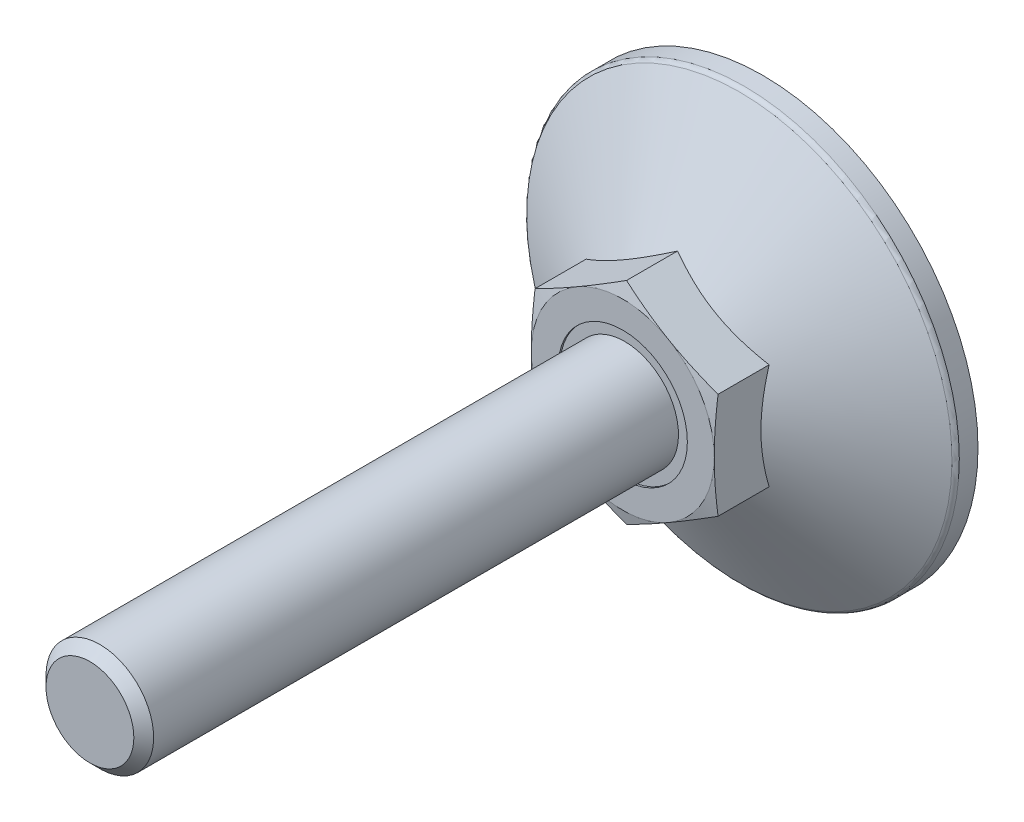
ISO-10303-21;
HEADER;
FILE_DESCRIPTION(('STEP AP214'),'2;1');
FILE_NAME('part.step','',(''),(''),'','','');
FILE_SCHEMA(('AUTOMOTIVE_DESIGN { 1 0 10303 214 1 1 1 1 }'));
ENDSEC;
DATA;
#1=APPLICATION_CONTEXT('core data for automotive mechanical design processes');
#2=APPLICATION_PROTOCOL_DEFINITION('international standard','automotive_design',2000,#1);
#3=PRODUCT_CONTEXT('',#1,'mechanical');
#4=PRODUCT('Part','Part','',(#3));
#5=PRODUCT_RELATED_PRODUCT_CATEGORY('part','',(#4));
#6=PRODUCT_DEFINITION_FORMATION('','',#4);
#7=PRODUCT_DEFINITION_CONTEXT('part definition',#1,'design');
#8=PRODUCT_DEFINITION('design','',#6,#7);
#9=PRODUCT_DEFINITION_SHAPE('','',#8);
#10=(LENGTH_UNIT() NAMED_UNIT(*) SI_UNIT(.MILLI.,.METRE.));
#11=(NAMED_UNIT(*) PLANE_ANGLE_UNIT() SI_UNIT($,.RADIAN.));
#12=(NAMED_UNIT(*) SI_UNIT($,.STERADIAN.) SOLID_ANGLE_UNIT());
#13=UNCERTAINTY_MEASURE_WITH_UNIT(LENGTH_MEASURE(1.E-05),#10,'distance_accuracy_value','');
#14=(GEOMETRIC_REPRESENTATION_CONTEXT(3) GLOBAL_UNCERTAINTY_ASSIGNED_CONTEXT((#13)) GLOBAL_UNIT_ASSIGNED_CONTEXT((#10,
#11,#12)) REPRESENTATION_CONTEXT('',''));
#15=CARTESIAN_POINT('',(0.,0.,0.));
#16=DIRECTION('',(0.,0.,1.));
#17=DIRECTION('',(1.,0.,0.));
#18=AXIS2_PLACEMENT_3D('',#15,#16,#17);
#19=CARTESIAN_POINT('',(0.,9.8149545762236,27.));
#20=DIRECTION('',(0.5,-0.86602540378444,0.));
#21=DIRECTION('',(0.86602540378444,0.5,0.));
#22=AXIS2_PLACEMENT_3D('',#19,#20,#21);
#23=PLANE('',#22);
#24=CARTESIAN_POINT('',(0.000200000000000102,9.81507004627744,12.6476280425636));
#25=CARTESIAN_POINT('',(-0.352800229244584,9.61126526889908,12.7022599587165));
#26=CARTESIAN_POINT('',(-0.706440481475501,9.40709097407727,12.7518566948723));
#27=CARTESIAN_POINT('',(-1.41496987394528,8.99802133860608,12.8389934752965));
#28=CARTESIAN_POINT('',(-1.76985946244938,8.79312573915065,12.8765286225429));
#29=CARTESIAN_POINT('',(-2.47873586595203,8.38385575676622,12.9373509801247));
#30=CARTESIAN_POINT('',(-2.83271788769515,8.17948414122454,12.9607107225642));
#31=CARTESIAN_POINT('',(-3.5411333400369,7.77048028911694,12.9920337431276));
#32=CARTESIAN_POINT('',(-3.89556667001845,7.56584811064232,13.));
#33=CARTESIAN_POINT('',(-4.60443332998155,7.15658375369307,13.));
#34=CARTESIAN_POINT('',(-4.9588666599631,6.95195157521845,12.9920337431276));
#35=CARTESIAN_POINT('',(-5.66728211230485,6.54294772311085,12.9607107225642));
#36=CARTESIAN_POINT('',(-6.02126413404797,6.33857610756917,12.9373509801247));
#37=CARTESIAN_POINT('',(-6.73014053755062,5.92930612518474,12.8765286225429));
#38=CARTESIAN_POINT('',(-7.08503012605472,5.7244105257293,12.8389934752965));
#39=CARTESIAN_POINT('',(-7.7935595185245,5.31534089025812,12.7518566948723));
#40=CARTESIAN_POINT('',(-8.14719977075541,5.11116659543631,12.7022599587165));
#41=CARTESIAN_POINT('',(-8.5002,4.90736181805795,12.6476280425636));
#42=B_SPLINE_CURVE_WITH_KNOTS('',3,(#24,#25,#26,#27,#28,#29,#30,#31,#32,#33,#34,#35,#36,#37,#38,
#39,#40,#41),.UNSPECIFIED.,.F.,.F.,(4,2,2,2,2,2,2,2,4),(0.,1.23382789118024,2.46815608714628,
3.69611406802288,4.92383440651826,6.15155474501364,7.37951272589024,8.61384092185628,
9.84766881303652),.UNSPECIFIED.);
#43=CARTESIAN_POINT('',(0.,9.8149545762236,12.6476589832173));
#44=VERTEX_POINT('',#43);
#45=CARTESIAN_POINT('',(-4.25,7.36121593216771,13.));
#46=VERTEX_POINT('',#45);
#47=EDGE_CURVE('E269',#44,#46,#42,.T.);
#48=ORIENTED_EDGE('',*,*,#47,.F.);
#49=DIRECTION('',(0.,0.,-1.));
#50=VECTOR('',#49,1.);
#51=CARTESIAN_POINT('',(0.,9.8149545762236,27.));
#52=LINE('',#51,#50);
#53=CARTESIAN_POINT('',(0.,9.8149545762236,7.90533871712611));
#54=VERTEX_POINT('',#53);
#55=EDGE_CURVE('E43',#44,#54,#52,.T.);
#56=ORIENTED_EDGE('',*,*,#55,.T.);
#57=CARTESIAN_POINT('',(-8.5002,4.90736181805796,7.90527204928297));
#58=CARTESIAN_POINT('',(-8.31336077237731,5.0152334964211,7.96754195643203));
#59=CARTESIAN_POINT('',(-8.1258249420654,5.12350735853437,8.02698579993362));
#60=CARTESIAN_POINT('',(-7.74923024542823,5.34093440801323,8.13944298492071));
#61=CARTESIAN_POINT('',(-7.56017075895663,5.45008795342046,8.19245355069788));
#62=CARTESIAN_POINT('',(-6.98996524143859,5.77929626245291,8.34079470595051));
#63=CARTESIAN_POINT('',(-6.60656835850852,6.00065055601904,8.42516916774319));
#64=CARTESIAN_POINT('',(-6.03282233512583,6.33190297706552,8.52410807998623));
#65=CARTESIAN_POINT('',(-5.8441872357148,6.44081150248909,8.55229289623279));
#66=CARTESIAN_POINT('',(-5.46606397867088,6.65912106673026,8.59955401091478));
#67=CARTESIAN_POINT('',(-5.27657589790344,6.76852206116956,8.61863111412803));
#68=CARTESIAN_POINT('',(-4.89727347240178,6.98751241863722,8.64719332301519));
#69=CARTESIAN_POINT('',(-4.70745974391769,7.0971014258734,8.65668931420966));
#70=CARTESIAN_POINT('',(-4.3276569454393,7.31638067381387,8.66588571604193));
#71=CARTESIAN_POINT('',(-4.13766788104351,7.42607091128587,8.66558642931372));
#72=CARTESIAN_POINT('',(-3.78247698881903,7.63114046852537,8.65587362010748));
#73=CARTESIAN_POINT('',(-3.61725009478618,7.7265342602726,8.64764492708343));
#74=CARTESIAN_POINT('',(-3.28718328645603,7.91709842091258,8.62393885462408));
#75=CARTESIAN_POINT('',(-3.12234339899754,8.01226877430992,8.60846098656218));
#76=CARTESIAN_POINT('',(-2.62846189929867,8.29741139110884,8.55151947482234));
#77=CARTESIAN_POINT('',(-2.30029449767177,8.48687892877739,8.49955503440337));
#78=CARTESIAN_POINT('',(-1.64047857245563,8.86782383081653,8.36964315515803));
#79=CARTESIAN_POINT('',(-1.30891425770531,9.0592525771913,8.29114502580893));
#80=CARTESIAN_POINT('',(-0.650730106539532,9.43925537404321,8.11298675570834));
#81=CARTESIAN_POINT('',(-0.324101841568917,9.62783429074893,8.01336845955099));
#82=CARTESIAN_POINT('',(0.000199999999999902,9.81507004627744,7.90527204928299));
#83=B_SPLINE_CURVE_WITH_KNOTS('',3,(#57,#58,#59,#60,#61,#62,#63,#64,#65,#66,#67,#68,#69,#70,#71,
#72,#73,#74,#75,#76,#77,#78,#79,#80,#81,#82),.UNSPECIFIED.,.F.,.F.,(4,2,2,2,2,2,2,2,2,2,2,2,4),
(0.,0.673596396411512,1.34748239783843,2.69805431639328,3.35679995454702,4.01548737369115,
4.67342558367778,5.33134346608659,5.90409556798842,6.47688628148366,7.62328361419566,
8.79510569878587,9.96462743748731),.UNSPECIFIED.);
#84=CARTESIAN_POINT('',(-8.5,4.9074772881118,7.90533871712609));
#85=VERTEX_POINT('',#84);
#86=EDGE_CURVE('E237',#85,#54,#83,.T.);
#87=ORIENTED_EDGE('',*,*,#86,.F.);
#88=DIRECTION('',(0.,0.,-1.));
#89=VECTOR('',#88,1.);
#90=CARTESIAN_POINT('',(-8.5,4.9074772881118,27.));
#91=LINE('',#90,#89);
#92=CARTESIAN_POINT('',(-8.5,4.9074772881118,12.6476589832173));
#93=VERTEX_POINT('',#92);
#94=EDGE_CURVE('E282',#93,#85,#91,.T.);
#95=ORIENTED_EDGE('',*,*,#94,.F.);
#96=EDGE_CURVE('E169',#46,#93,#42,.T.);
#97=ORIENTED_EDGE('',*,*,#96,.F.);
#98=EDGE_LOOP('',(#48,#56,#87,#95,#97));
#99=FACE_BOUND('',#98,.T.);
#100=ADVANCED_FACE('F14',(#99),#23,.F.);
#101=CARTESIAN_POINT('',(8.5,4.9074772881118,27.));
#102=DIRECTION('',(-0.5,-0.86602540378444,0.));
#103=DIRECTION('',(0.86602540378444,-0.5,0.));
#104=AXIS2_PLACEMENT_3D('',#101,#102,#103);
#105=PLANE('',#104);
#106=CARTESIAN_POINT('',(8.5002,4.90736181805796,12.6476280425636));
#107=CARTESIAN_POINT('',(8.14719977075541,5.11116659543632,12.7022599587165));
#108=CARTESIAN_POINT('',(7.7935595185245,5.31534089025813,12.7518566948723));
#109=CARTESIAN_POINT('',(7.08503012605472,5.72441052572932,12.8389934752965));
#110=CARTESIAN_POINT('',(6.73014053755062,5.92930612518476,12.8765286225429));
#111=CARTESIAN_POINT('',(6.02126413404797,6.33857610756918,12.9373509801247));
#112=CARTESIAN_POINT('',(5.66728211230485,6.54294772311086,12.9607107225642));
#113=CARTESIAN_POINT('',(4.9588666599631,6.95195157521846,12.9920337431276));
#114=CARTESIAN_POINT('',(4.60443332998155,7.15658375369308,13.));
#115=CARTESIAN_POINT('',(3.89556667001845,7.56584811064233,13.));
#116=CARTESIAN_POINT('',(3.5411333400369,7.77048028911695,12.9920337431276));
#117=CARTESIAN_POINT('',(2.83271788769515,8.17948414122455,12.9607107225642));
#118=CARTESIAN_POINT('',(2.47873586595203,8.38385575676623,12.9373509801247));
#119=CARTESIAN_POINT('',(1.76985946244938,8.79312573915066,12.8765286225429));
#120=CARTESIAN_POINT('',(1.41496987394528,8.9980213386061,12.8389934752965));
#121=CARTESIAN_POINT('',(0.706440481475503,9.40709097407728,12.7518566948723));
#122=CARTESIAN_POINT('',(0.352800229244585,9.61126526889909,12.7022599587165));
#123=CARTESIAN_POINT('',(-0.000200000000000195,9.81507004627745,12.6476280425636));
#124=B_SPLINE_CURVE_WITH_KNOTS('',3,(#106,#107,#108,#109,#110,#111,#112,#113,#114,#115,#116,
#117,#118,#119,#120,#121,#122,#123),.UNSPECIFIED.,.F.,.F.,(4,2,2,2,2,2,2,2,4),(0.,
1.23382789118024,2.46815608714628,3.69611406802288,4.92383440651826,6.15155474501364,
7.37951272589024,8.61384092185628,9.84766881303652),.UNSPECIFIED.);
#125=CARTESIAN_POINT('',(8.5,4.9074772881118,12.6476589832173));
#126=VERTEX_POINT('',#125);
#127=CARTESIAN_POINT('',(4.25,7.36121593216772,13.));
#128=VERTEX_POINT('',#127);
#129=EDGE_CURVE('E121',#126,#128,#124,.T.);
#130=ORIENTED_EDGE('',*,*,#129,.F.);
#131=DIRECTION('',(0.,0.,-1.));
#132=VECTOR('',#131,1.);
#133=CARTESIAN_POINT('',(8.5,4.9074772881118,27.));
#134=LINE('',#133,#132);
#135=CARTESIAN_POINT('',(8.5,4.9074772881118,7.90533871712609));
#136=VERTEX_POINT('',#135);
#137=EDGE_CURVE('E128',#126,#136,#134,.T.);
#138=ORIENTED_EDGE('',*,*,#137,.T.);
#139=CARTESIAN_POINT('',(-0.0002,9.81507004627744,7.90527204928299));
#140=CARTESIAN_POINT('',(0.186639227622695,9.7071983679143,7.96754195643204));
#141=CARTESIAN_POINT('',(0.374175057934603,9.59892450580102,8.02698579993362));
#142=CARTESIAN_POINT('',(0.750769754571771,9.38149745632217,8.13944298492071));
#143=CARTESIAN_POINT('',(0.939829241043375,9.27234391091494,8.19245355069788));
#144=CARTESIAN_POINT('',(1.51003475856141,8.94313560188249,8.34079470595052));
#145=CARTESIAN_POINT('',(1.89343164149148,8.72178130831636,8.42516916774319));
#146=CARTESIAN_POINT('',(2.46717766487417,8.39052888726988,8.52410807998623));
#147=CARTESIAN_POINT('',(2.6558127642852,8.28162036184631,8.55229289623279));
#148=CARTESIAN_POINT('',(3.03393602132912,8.06331079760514,8.59955401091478));
#149=CARTESIAN_POINT('',(3.22342410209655,7.95390980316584,8.61863111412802));
#150=CARTESIAN_POINT('',(3.60272652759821,7.73491944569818,8.64719332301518));
#151=CARTESIAN_POINT('',(3.79254025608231,7.62533043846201,8.65668931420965));
#152=CARTESIAN_POINT('',(4.1723430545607,7.40605119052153,8.66588571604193));
#153=CARTESIAN_POINT('',(4.36233211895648,7.29636095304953,8.66558642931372));
#154=CARTESIAN_POINT('',(4.71752301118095,7.09129139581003,8.65587362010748));
#155=CARTESIAN_POINT('',(4.88274990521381,6.9958976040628,8.64764492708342));
#156=CARTESIAN_POINT('',(5.21281671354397,6.80533344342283,8.62393885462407));
#157=CARTESIAN_POINT('',(5.37765660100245,6.71016309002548,8.60846098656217));
#158=CARTESIAN_POINT('',(5.87153810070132,6.42502047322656,8.55151947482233));
#159=CARTESIAN_POINT('',(6.19970550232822,6.23555293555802,8.49955503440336));
#160=CARTESIAN_POINT('',(6.85952142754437,5.85460803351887,8.36964315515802));
#161=CARTESIAN_POINT('',(7.19108574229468,5.6631792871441,8.29114502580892));
#162=CARTESIAN_POINT('',(7.84926989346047,5.28317649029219,8.11298675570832));
#163=CARTESIAN_POINT('',(8.17589815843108,5.09459757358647,8.01336845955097));
#164=CARTESIAN_POINT('',(8.5002,4.90736181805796,7.90527204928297));
#165=B_SPLINE_CURVE_WITH_KNOTS('',3,(#139,#140,#141,#142,#143,#144,#145,#146,#147,#148,#149,
#150,#151,#152,#153,#154,#155,#156,#157,#158,#159,#160,#161,#162,#163,#164),.UNSPECIFIED.,.F.,
.F.,(4,2,2,2,2,2,2,2,2,2,2,2,4),(0.,0.673596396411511,1.34748239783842,2.69805431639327,
3.35679995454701,4.01548737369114,4.67342558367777,5.33134346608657,5.90409556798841,
6.47688628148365,7.62328361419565,8.79510569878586,9.96462743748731),.UNSPECIFIED.);
#166=EDGE_CURVE('E231',#54,#136,#165,.T.);
#167=ORIENTED_EDGE('',*,*,#166,.F.);
#168=ORIENTED_EDGE('',*,*,#55,.F.);
#169=EDGE_CURVE('E138',#128,#44,#124,.T.);
#170=ORIENTED_EDGE('',*,*,#169,.F.);
#171=EDGE_LOOP('',(#130,#138,#167,#168,#170));
#172=FACE_BOUND('',#171,.T.);
#173=ADVANCED_FACE('F243',(#172),#105,.F.);
#174=CARTESIAN_POINT('',(8.5,-4.9074772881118,27.));
#175=DIRECTION('',(-1.,0.,0.));
#176=DIRECTION('',(0.,-1.,0.));
#177=AXIS2_PLACEMENT_3D('',#174,#175,#176);
#178=PLANE('',#177);
#179=CARTESIAN_POINT('',(8.5,-12.9964437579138,11.1165186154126));
#180=CARTESIAN_POINT('',(8.5,-12.6106593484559,11.2030063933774));
#181=CARTESIAN_POINT('',(8.5,-12.2246340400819,11.288438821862));
#182=CARTESIAN_POINT('',(8.5,-11.451983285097,11.456623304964));
#183=CARTESIAN_POINT('',(8.5,-11.0653578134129,11.5393752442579));
#184=CARTESIAN_POINT('',(8.5,-10.2910440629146,11.7017006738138));
#185=CARTESIAN_POINT('',(8.5,-9.90335511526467,11.7812709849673));
#186=CARTESIAN_POINT('',(8.5,-9.1271713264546,11.9363765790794));
#187=CARTESIAN_POINT('',(8.5,-8.7386764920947,12.0119118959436));
#188=CARTESIAN_POINT('',(8.5,-7.96383603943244,12.1574047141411));
#189=CARTESIAN_POINT('',(8.5,-7.57749788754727,12.2274017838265));
#190=CARTESIAN_POINT('',(8.5,-6.80376856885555,12.3613005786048));
#191=CARTESIAN_POINT('',(8.5,-6.41637742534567,12.4252024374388));
#192=CARTESIAN_POINT('',(8.5,-5.64046520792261,12.5454750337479));
#193=CARTESIAN_POINT('',(8.5,-5.25194427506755,12.6018466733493));
#194=CARTESIAN_POINT('',(8.5,-4.47366558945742,12.7054002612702));
#195=CARTESIAN_POINT('',(8.5,-4.08390783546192,12.7525822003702));
#196=CARTESIAN_POINT('',(8.5,-3.29875235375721,12.8364234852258));
#197=CARTESIAN_POINT('',(8.5,-2.90334096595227,12.872956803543));
#198=CARTESIAN_POINT('',(8.5,-2.11152101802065,12.9329824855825));
#199=CARTESIAN_POINT('',(8.5,-1.71511248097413,12.9564751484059));
#200=CARTESIAN_POINT('',(8.5,-0.921873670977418,12.989049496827));
#201=CARTESIAN_POINT('',(8.5,-0.525043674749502,12.998137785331));
#202=CARTESIAN_POINT('',(8.5,0.268677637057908,13.0013442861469));
#203=CARTESIAN_POINT('',(8.5,0.665568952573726,12.9954625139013));
#204=CARTESIAN_POINT('',(8.5,1.46030003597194,12.9690595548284));
#205=CARTESIAN_POINT('',(8.5,1.85813800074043,12.9484851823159));
#206=CARTESIAN_POINT('',(8.5,2.6528802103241,12.893872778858));
#207=CARTESIAN_POINT('',(8.5,3.0497844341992,12.8598344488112));
#208=CARTESIAN_POINT('',(8.5,3.84265546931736,12.7800170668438));
#209=CARTESIAN_POINT('',(8.5,4.23862149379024,12.7342303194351));
#210=CARTESIAN_POINT('',(8.5,5.02927866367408,12.6328257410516));
#211=CARTESIAN_POINT('',(8.5,5.42396980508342,12.5772078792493));
#212=CARTESIAN_POINT('',(8.5,6.18702440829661,12.4617222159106));
#213=CARTESIAN_POINT('',(8.5,6.55546374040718,12.4023506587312));
#214=CARTESIAN_POINT('',(8.5,7.29136811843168,12.2778215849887));
#215=CARTESIAN_POINT('',(8.5,7.65883313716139,12.2126639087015));
#216=CARTESIAN_POINT('',(8.5,8.39292389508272,12.0776225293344));
#217=CARTESIAN_POINT('',(8.5,8.7595495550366,12.0077383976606));
#218=CARTESIAN_POINT('',(8.5,9.49204728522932,11.8641155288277));
#219=CARTESIAN_POINT('',(8.5,9.85791934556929,11.7903767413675));
#220=CARTESIAN_POINT('',(8.5,10.5890956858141,11.6397268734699));
#221=CARTESIAN_POINT('',(8.5,10.9543998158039,11.5628150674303));
#222=CARTESIAN_POINT('',(8.5,11.68445119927,11.406388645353));
#223=CARTESIAN_POINT('',(8.5,12.0491984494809,11.3268740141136));
#224=CARTESIAN_POINT('',(8.5,13.1426801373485,11.0851301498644));
#225=CARTESIAN_POINT('',(8.5,13.8707045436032,10.9196905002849));
#226=CARTESIAN_POINT('',(8.5,15.3182055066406,10.5845026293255));
#227=CARTESIAN_POINT('',(8.5,16.0376956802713,10.4148128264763));
#228=CARTESIAN_POINT('',(8.5,17.4756735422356,10.0711866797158));
#229=CARTESIAN_POINT('',(8.5,18.194161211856,9.89725025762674));
#230=CARTESIAN_POINT('',(8.5,19.6294758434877,9.54646391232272));
#231=CARTESIAN_POINT('',(8.5,20.3463037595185,9.36961788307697));
#232=CARTESIAN_POINT('',(8.5,21.7793360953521,9.01351663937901));
#233=CARTESIAN_POINT('',(8.5,22.495540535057,8.8342615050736));
#234=CARTESIAN_POINT('',(8.5,23.2115279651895,8.65415335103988));
#235=B_SPLINE_CURVE_WITH_KNOTS('',3,(#179,#180,#181,#182,#183,#184,#185,#186,#187,#188,#189,
#190,#191,#192,#193,#194,#195,#196,#197,#198,#199,#200,#201,#202,#203,#204,#205,#206,#207,#208,
#209,#210,#211,#212,#213,#214,#215,#216,#217,#218,#219,#220,#221,#222,#223,#224,#225,#226,#227,
#228,#229,#230,#231,#232,#233,#234),.UNSPECIFIED.,.F.,.F.,(4,2,2,2,2,2,2,2,2,2,2,2,2,2,2,2,2,2,
2,2,2,2,2,2,2,2,2,4),(0.,1.18608563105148,2.37222222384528,3.55951581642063,4.74679943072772,
5.92464448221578,7.10246368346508,8.28014165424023,9.45782080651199,10.6489192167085,
11.8399903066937,13.0305152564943,14.2210389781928,15.4158942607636,16.6107760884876,
17.8064425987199,19.0021128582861,20.1216354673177,21.2411889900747,22.3608441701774,
23.4805139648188,24.6004412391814,25.7203750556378,27.960089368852,30.1777638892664,
32.3954792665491,34.6104355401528,36.825318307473),.UNSPECIFIED.);
#236=CARTESIAN_POINT('',(8.5,-4.90747728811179,12.6476589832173));
#237=VERTEX_POINT('',#236);
#238=CARTESIAN_POINT('',(8.5,0.,13.));
#239=VERTEX_POINT('',#238);
#240=EDGE_CURVE('E95',#237,#239,#235,.T.);
#241=ORIENTED_EDGE('',*,*,#240,.F.);
#242=DIRECTION('',(0.,0.,-1.));
#243=VECTOR('',#242,1.);
#244=CARTESIAN_POINT('',(8.5,-4.9074772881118,27.));
#245=LINE('',#244,#243);
#246=CARTESIAN_POINT('',(8.5,-4.9074772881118,7.90533871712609));
#247=VERTEX_POINT('',#246);
#248=EDGE_CURVE('E275',#237,#247,#245,.T.);
#249=ORIENTED_EDGE('',*,*,#248,.T.);
#250=CARTESIAN_POINT('',(8.5,12.7492767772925,4.72527230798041));
#251=CARTESIAN_POINT('',(8.5,12.3811478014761,4.90206026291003));
#252=CARTESIAN_POINT('',(8.5,12.0121249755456,5.07702151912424));
#253=CARTESIAN_POINT('',(8.5,11.2718137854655,5.42225230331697));
#254=CARTESIAN_POINT('',(8.5,10.9005250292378,5.59252098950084));
#255=CARTESIAN_POINT('',(8.5,10.1530767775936,5.92827896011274));
#256=CARTESIAN_POINT('',(8.5,9.77690140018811,6.09373302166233));
#257=CARTESIAN_POINT('',(8.5,9.02139912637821,6.41725455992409));
#258=CARTESIAN_POINT('',(8.5,8.64207239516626,6.57532242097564));
#259=CARTESIAN_POINT('',(8.5,7.86979942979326,6.88607334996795));
#260=CARTESIAN_POINT('',(8.5,7.47675434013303,7.03851219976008));
#261=CARTESIAN_POINT('',(8.5,6.68591204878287,7.33076935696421));
#262=CARTESIAN_POINT('',(8.5,6.28811429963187,7.47058619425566));
#263=CARTESIAN_POINT('',(8.5,5.48802263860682,7.733611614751));
#264=CARTESIAN_POINT('',(8.5,5.08574124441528,7.85685783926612));
#265=CARTESIAN_POINT('',(8.5,4.27544970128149,8.08251258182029));
#266=CARTESIAN_POINT('',(8.5,3.86744153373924,8.18492812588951));
#267=CARTESIAN_POINT('',(8.5,3.04728386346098,8.36327495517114));
#268=CARTESIAN_POINT('',(8.5,2.6351585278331,8.43931422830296));
#269=CARTESIAN_POINT('',(8.5,2.01359122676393,8.53003978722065));
#270=CARTESIAN_POINT('',(8.5,1.80582110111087,8.55639399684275));
#271=CARTESIAN_POINT('',(8.5,1.38940213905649,8.60080126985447));
#272=CARTESIAN_POINT('',(8.5,1.18075338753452,8.61885511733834));
#273=CARTESIAN_POINT('',(8.5,0.765376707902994,8.64609671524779));
#274=CARTESIAN_POINT('',(8.5,0.558655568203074,8.65538769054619));
#275=CARTESIAN_POINT('',(8.5,0.1450067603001,8.66526416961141));
#276=CARTESIAN_POINT('',(8.5,-0.0619209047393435,8.6658498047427));
#277=CARTESIAN_POINT('',(8.5,-0.475626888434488,8.65830085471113));
#278=CARTESIAN_POINT('',(8.5,-0.682405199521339,8.65016585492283));
#279=CARTESIAN_POINT('',(8.5,-1.09545270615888,8.625363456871));
#280=CARTESIAN_POINT('',(8.5,-1.30172187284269,8.60869558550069));
#281=CARTESIAN_POINT('',(8.5,-1.81090940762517,8.55735076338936));
#282=CARTESIAN_POINT('',(8.5,-2.11335210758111,8.51788364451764));
#283=CARTESIAN_POINT('',(8.5,-2.71570235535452,8.4228634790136));
#284=CARTESIAN_POINT('',(8.5,-3.01560949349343,8.36730788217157));
#285=CARTESIAN_POINT('',(8.5,-3.61268959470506,8.2420877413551));
#286=CARTESIAN_POINT('',(8.5,-3.90986014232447,8.17241178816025));
#287=CARTESIAN_POINT('',(8.5,-4.50108875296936,8.02104250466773));
#288=CARTESIAN_POINT('',(8.5,-4.79514688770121,7.93934945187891));
#289=CARTESIAN_POINT('',(8.5,-5.3871494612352,7.7638116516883));
#290=CARTESIAN_POINT('',(8.5,-5.68502188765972,7.6697256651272));
#291=CARTESIAN_POINT('',(8.5,-6.27782977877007,7.4727599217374));
#292=CARTESIAN_POINT('',(8.5,-6.57276522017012,7.36988009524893));
#293=CARTESIAN_POINT('',(8.5,-7.15987047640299,7.15687683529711));
#294=CARTESIAN_POINT('',(8.5,-7.45204129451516,7.04675615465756));
#295=CARTESIAN_POINT('',(8.5,-8.03401937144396,6.82048197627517));
#296=CARTESIAN_POINT('',(8.5,-8.32382669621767,6.70432864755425));
#297=CARTESIAN_POINT('',(8.5,-8.8985343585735,6.468166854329));
#298=CARTESIAN_POINT('',(8.5,-9.18345493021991,6.34820749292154));
#299=CARTESIAN_POINT('',(8.5,-9.75152375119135,6.10415692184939));
#300=CARTESIAN_POINT('',(8.5,-10.034671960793,5.98006561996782));
#301=CARTESIAN_POINT('',(8.5,-10.8818575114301,5.60257794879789));
#302=CARTESIAN_POINT('',(8.5,-11.4435817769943,5.34399030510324));
#303=CARTESIAN_POINT('',(8.5,-12.5625477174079,4.81675169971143));
#304=CARTESIAN_POINT('',(8.5,-13.1197873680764,4.54809647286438));
#305=CARTESIAN_POINT('',(8.5,-14.2306052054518,4.00340707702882));
#306=CARTESIAN_POINT('',(8.5,-14.7841835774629,3.72737328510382));
#307=CARTESIAN_POINT('',(8.5,-15.8894273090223,3.16924748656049));
#308=CARTESIAN_POINT('',(8.5,-16.4410879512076,2.88714616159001));
#309=CARTESIAN_POINT('',(8.5,-17.5421722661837,2.31860293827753));
#310=CARTESIAN_POINT('',(8.5,-18.0915959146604,2.03216099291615));
#311=CARTESIAN_POINT('',(8.5,-19.1885131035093,1.45593769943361));
#312=CARTESIAN_POINT('',(8.5,-19.7360070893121,1.1661571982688));
#313=CARTESIAN_POINT('',(8.5,-20.8295421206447,0.583866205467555));
#314=CARTESIAN_POINT('',(8.5,-21.3755831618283,0.291355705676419));
#315=CARTESIAN_POINT('',(8.5,-22.8810608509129,-0.519031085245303));
#316=CARTESIAN_POINT('',(8.5,-23.8392547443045,-1.03921546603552));
#317=CARTESIAN_POINT('',(8.5,-25.7530641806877,-2.08445783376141));
#318=CARTESIAN_POINT('',(8.5,-26.708679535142,-2.60951616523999));
#319=CARTESIAN_POINT('',(8.5,-28.6148788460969,-3.66152013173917));
#320=CARTESIAN_POINT('',(8.5,-29.565469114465,-4.18845433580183));
#321=CARTESIAN_POINT('',(8.5,-30.9901906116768,-4.98085413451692));
#322=CARTESIAN_POINT('',(8.5,-31.4648842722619,-5.24530955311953));
#323=CARTESIAN_POINT('',(8.5,-32.4139385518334,-5.77481644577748));
#324=CARTESIAN_POINT('',(8.5,-32.8882991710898,-6.03986791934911));
#325=CARTESIAN_POINT('',(8.5,-33.3625145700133,-6.30517901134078));
#326=B_SPLINE_CURVE_WITH_KNOTS('',3,(#250,#251,#252,#253,#254,#255,#256,#257,#258,#259,#260,
#261,#262,#263,#264,#265,#266,#267,#268,#269,#270,#271,#272,#273,#274,#275,#276,#277,#278,#279,
#280,#281,#282,#283,#284,#285,#286,#287,#288,#289,#290,#291,#292,#293,#294,#295,#296,#297,#298,
#299,#300,#301,#302,#303,#304,#305,#306,#307,#308,#309,#310,#311,#312,#313,#314,#315,#316,#317,
#318,#319,#320,#321,#322,#323,#324,#325),.UNSPECIFIED.,.F.,.F.,(4,2,2,2,2,2,2,2,2,2,2,2,2,2,2,2,
2,2,2,2,2,2,2,2,2,2,2,2,2,2,2,2,2,2,2,2,2,4),(0.,1.22515253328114,2.45052343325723,
3.6833213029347,4.91605495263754,6.18059988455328,7.44529191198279,8.70706073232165,
9.96840325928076,11.2245189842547,11.852683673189,12.4807890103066,13.1013994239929,
13.7220004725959,14.3426310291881,14.9632960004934,15.8778021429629,16.7924533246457,
17.7078465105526,18.6232185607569,19.5601888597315,20.4971665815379,21.433790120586,
22.3703874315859,23.297780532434,24.225194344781,26.0801973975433,27.9359954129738,
29.7916987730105,31.6504906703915,33.5093027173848,35.3676531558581,37.2260091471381,
40.4968499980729,43.7679238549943,47.0285209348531,48.6586852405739,50.2888482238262),.UNSPECIFIED.);
#327=EDGE_CURVE('E197',#136,#247,#326,.T.);
#328=ORIENTED_EDGE('',*,*,#327,.F.);
#329=ORIENTED_EDGE('',*,*,#137,.F.);
#330=EDGE_CURVE('E106',#239,#126,#235,.T.);
#331=ORIENTED_EDGE('',*,*,#330,.F.);
#332=EDGE_LOOP('',(#241,#249,#328,#329,#331));
#333=FACE_BOUND('',#332,.T.);
#334=ADVANCED_FACE('F126',(#333),#178,.F.);
#335=CARTESIAN_POINT('',(0.,-9.8149545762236,27.));
#336=DIRECTION('',(-0.5,0.86602540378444,0.));
#337=DIRECTION('',(-0.86602540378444,-0.5,0.));
#338=AXIS2_PLACEMENT_3D('',#335,#336,#337);
#339=PLANE('',#338);
#340=CARTESIAN_POINT('',(-0.000200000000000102,-9.81507004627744,12.6476280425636));
#341=CARTESIAN_POINT('',(0.352800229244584,-9.61126526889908,12.7022599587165));
#342=CARTESIAN_POINT('',(0.706440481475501,-9.40709097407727,12.7518566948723));
#343=CARTESIAN_POINT('',(1.41496987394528,-8.99802133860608,12.8389934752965));
#344=CARTESIAN_POINT('',(1.76985946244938,-8.79312573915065,12.8765286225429));
#345=CARTESIAN_POINT('',(2.47873586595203,-8.38385575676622,12.9373509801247));
#346=CARTESIAN_POINT('',(2.83271788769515,-8.17948414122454,12.9607107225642));
#347=CARTESIAN_POINT('',(3.5411333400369,-7.77048028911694,12.9920337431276));
#348=CARTESIAN_POINT('',(3.89556667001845,-7.56584811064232,13.));
#349=CARTESIAN_POINT('',(4.60443332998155,-7.15658375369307,13.));
#350=CARTESIAN_POINT('',(4.9588666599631,-6.95195157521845,12.9920337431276));
#351=CARTESIAN_POINT('',(5.66728211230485,-6.54294772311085,12.9607107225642));
#352=CARTESIAN_POINT('',(6.02126413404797,-6.33857610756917,12.9373509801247));
#353=CARTESIAN_POINT('',(6.73014053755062,-5.92930612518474,12.8765286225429));
#354=CARTESIAN_POINT('',(7.08503012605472,-5.7244105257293,12.8389934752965));
#355=CARTESIAN_POINT('',(7.7935595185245,-5.31534089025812,12.7518566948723));
#356=CARTESIAN_POINT('',(8.14719977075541,-5.11116659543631,12.7022599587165));
#357=CARTESIAN_POINT('',(8.5002,-4.90736181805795,12.6476280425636));
#358=B_SPLINE_CURVE_WITH_KNOTS('',3,(#340,#341,#342,#343,#344,#345,#346,#347,#348,#349,#350,
#351,#352,#353,#354,#355,#356,#357),.UNSPECIFIED.,.F.,.F.,(4,2,2,2,2,2,2,2,4),(0.,
1.23382789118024,2.46815608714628,3.69611406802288,4.92383440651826,6.15155474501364,
7.37951272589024,8.61384092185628,9.84766881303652),.UNSPECIFIED.);
#359=CARTESIAN_POINT('',(0.,-9.81495457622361,12.6476589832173));
#360=VERTEX_POINT('',#359);
#361=CARTESIAN_POINT('',(4.25,-7.36121593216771,13.));
#362=VERTEX_POINT('',#361);
#363=EDGE_CURVE('E130',#360,#362,#358,.T.);
#364=ORIENTED_EDGE('',*,*,#363,.F.);
#365=DIRECTION('',(0.,0.,-1.));
#366=VECTOR('',#365,1.);
#367=CARTESIAN_POINT('',(0.,-9.8149545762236,27.));
#368=LINE('',#367,#366);
#369=CARTESIAN_POINT('',(0.,-9.8149545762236,7.90533871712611));
#370=VERTEX_POINT('',#369);
#371=EDGE_CURVE('E279',#360,#370,#368,.T.);
#372=ORIENTED_EDGE('',*,*,#371,.T.);
#373=CARTESIAN_POINT('',(8.5002,-4.90736181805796,7.90527204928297));
#374=CARTESIAN_POINT('',(8.31336077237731,-5.0152334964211,7.96754195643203));
#375=CARTESIAN_POINT('',(8.1258249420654,-5.12350735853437,8.02698579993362));
#376=CARTESIAN_POINT('',(7.74923024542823,-5.34093440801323,8.13944298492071));
#377=CARTESIAN_POINT('',(7.56017075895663,-5.45008795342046,8.19245355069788));
#378=CARTESIAN_POINT('',(6.98996524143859,-5.77929626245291,8.34079470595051));
#379=CARTESIAN_POINT('',(6.60656835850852,-6.00065055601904,8.42516916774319));
#380=CARTESIAN_POINT('',(6.03282233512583,-6.33190297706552,8.52410807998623));
#381=CARTESIAN_POINT('',(5.8441872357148,-6.44081150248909,8.55229289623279));
#382=CARTESIAN_POINT('',(5.46606397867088,-6.65912106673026,8.59955401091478));
#383=CARTESIAN_POINT('',(5.27657589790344,-6.76852206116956,8.61863111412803));
#384=CARTESIAN_POINT('',(4.89727347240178,-6.98751241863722,8.64719332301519));
#385=CARTESIAN_POINT('',(4.70745974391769,-7.0971014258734,8.65668931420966));
#386=CARTESIAN_POINT('',(4.3276569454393,-7.31638067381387,8.66588571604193));
#387=CARTESIAN_POINT('',(4.13766788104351,-7.42607091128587,8.66558642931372));
#388=CARTESIAN_POINT('',(3.78247698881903,-7.63114046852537,8.65587362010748));
#389=CARTESIAN_POINT('',(3.61725009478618,-7.7265342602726,8.64764492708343));
#390=CARTESIAN_POINT('',(3.28718328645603,-7.91709842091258,8.62393885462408));
#391=CARTESIAN_POINT('',(3.12234339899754,-8.01226877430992,8.60846098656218));
#392=CARTESIAN_POINT('',(2.62846189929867,-8.29741139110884,8.55151947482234));
#393=CARTESIAN_POINT('',(2.30029449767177,-8.48687892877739,8.49955503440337));
#394=CARTESIAN_POINT('',(1.64047857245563,-8.86782383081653,8.36964315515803));
#395=CARTESIAN_POINT('',(1.30891425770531,-9.0592525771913,8.29114502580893));
#396=CARTESIAN_POINT('',(0.650730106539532,-9.43925537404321,8.11298675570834));
#397=CARTESIAN_POINT('',(0.324101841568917,-9.62783429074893,8.01336845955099));
#398=CARTESIAN_POINT('',(-0.000199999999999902,-9.81507004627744,7.90527204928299));
#399=B_SPLINE_CURVE_WITH_KNOTS('',3,(#373,#374,#375,#376,#377,#378,#379,#380,#381,#382,#383,
#384,#385,#386,#387,#388,#389,#390,#391,#392,#393,#394,#395,#396,#397,#398),.UNSPECIFIED.,.F.,
.F.,(4,2,2,2,2,2,2,2,2,2,2,2,4),(0.,0.673596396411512,1.34748239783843,2.69805431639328,
3.35679995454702,4.01548737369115,4.67342558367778,5.33134346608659,5.90409556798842,
6.47688628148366,7.62328361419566,8.79510569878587,9.96462743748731),.UNSPECIFIED.);
#400=EDGE_CURVE('E188',#247,#370,#399,.T.);
#401=ORIENTED_EDGE('',*,*,#400,.F.);
#402=ORIENTED_EDGE('',*,*,#248,.F.);
#403=EDGE_CURVE('E101',#362,#237,#358,.T.);
#404=ORIENTED_EDGE('',*,*,#403,.F.);
#405=EDGE_LOOP('',(#364,#372,#401,#402,#404));
#406=FACE_BOUND('',#405,.T.);
#407=ADVANCED_FACE('F180',(#406),#339,.F.);
#408=CARTESIAN_POINT('',(-8.5,-4.9074772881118,27.));
#409=DIRECTION('',(0.5,0.86602540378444,0.));
#410=DIRECTION('',(-0.86602540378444,0.5,0.));
#411=AXIS2_PLACEMENT_3D('',#408,#409,#410);
#412=PLANE('',#411);
#413=CARTESIAN_POINT('',(-8.5002,-4.90736181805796,12.6476280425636));
#414=CARTESIAN_POINT('',(-8.14719977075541,-5.11116659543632,12.7022599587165));
#415=CARTESIAN_POINT('',(-7.7935595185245,-5.31534089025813,12.7518566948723));
#416=CARTESIAN_POINT('',(-7.08503012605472,-5.72441052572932,12.8389934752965));
#417=CARTESIAN_POINT('',(-6.73014053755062,-5.92930612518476,12.8765286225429));
#418=CARTESIAN_POINT('',(-6.02126413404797,-6.33857610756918,12.9373509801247));
#419=CARTESIAN_POINT('',(-5.66728211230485,-6.54294772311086,12.9607107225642));
#420=CARTESIAN_POINT('',(-4.9588666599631,-6.95195157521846,12.9920337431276));
#421=CARTESIAN_POINT('',(-4.60443332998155,-7.15658375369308,13.));
#422=CARTESIAN_POINT('',(-3.89556667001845,-7.56584811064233,13.));
#423=CARTESIAN_POINT('',(-3.5411333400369,-7.77048028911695,12.9920337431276));
#424=CARTESIAN_POINT('',(-2.83271788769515,-8.17948414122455,12.9607107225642));
#425=CARTESIAN_POINT('',(-2.47873586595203,-8.38385575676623,12.9373509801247));
#426=CARTESIAN_POINT('',(-1.76985946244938,-8.79312573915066,12.8765286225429));
#427=CARTESIAN_POINT('',(-1.41496987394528,-8.9980213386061,12.8389934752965));
#428=CARTESIAN_POINT('',(-0.706440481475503,-9.40709097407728,12.7518566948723));
#429=CARTESIAN_POINT('',(-0.352800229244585,-9.61126526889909,12.7022599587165));
#430=CARTESIAN_POINT('',(0.000200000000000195,-9.81507004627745,12.6476280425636));
#431=B_SPLINE_CURVE_WITH_KNOTS('',3,(#413,#414,#415,#416,#417,#418,#419,#420,#421,#422,#423,
#424,#425,#426,#427,#428,#429,#430),.UNSPECIFIED.,.F.,.F.,(4,2,2,2,2,2,2,2,4),(0.,
1.23382789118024,2.46815608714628,3.69611406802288,4.92383440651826,6.15155474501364,
7.37951272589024,8.61384092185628,9.84766881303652),.UNSPECIFIED.);
#432=CARTESIAN_POINT('',(-8.5,-4.9074772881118,12.6476589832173));
#433=VERTEX_POINT('',#432);
#434=CARTESIAN_POINT('',(-4.25,-7.36121593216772,13.));
#435=VERTEX_POINT('',#434);
#436=EDGE_CURVE('E161',#433,#435,#431,.T.);
#437=ORIENTED_EDGE('',*,*,#436,.F.);
#438=DIRECTION('',(0.,0.,-1.));
#439=VECTOR('',#438,1.);
#440=CARTESIAN_POINT('',(-8.5,-4.9074772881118,27.));
#441=LINE('',#440,#439);
#442=CARTESIAN_POINT('',(-8.5,-4.9074772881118,7.90533871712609));
#443=VERTEX_POINT('',#442);
#444=EDGE_CURVE('E281',#433,#443,#441,.T.);
#445=ORIENTED_EDGE('',*,*,#444,.T.);
#446=CARTESIAN_POINT('',(0.0002,-9.81507004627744,7.90527204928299));
#447=CARTESIAN_POINT('',(-0.186639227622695,-9.7071983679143,7.96754195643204));
#448=CARTESIAN_POINT('',(-0.374175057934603,-9.59892450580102,8.02698579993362));
#449=CARTESIAN_POINT('',(-0.750769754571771,-9.38149745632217,8.13944298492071));
#450=CARTESIAN_POINT('',(-0.939829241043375,-9.27234391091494,8.19245355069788));
#451=CARTESIAN_POINT('',(-1.51003475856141,-8.94313560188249,8.34079470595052));
#452=CARTESIAN_POINT('',(-1.89343164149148,-8.72178130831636,8.42516916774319));
#453=CARTESIAN_POINT('',(-2.46717766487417,-8.39052888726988,8.52410807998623));
#454=CARTESIAN_POINT('',(-2.6558127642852,-8.28162036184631,8.55229289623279));
#455=CARTESIAN_POINT('',(-3.03393602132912,-8.06331079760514,8.59955401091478));
#456=CARTESIAN_POINT('',(-3.22342410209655,-7.95390980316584,8.61863111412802));
#457=CARTESIAN_POINT('',(-3.60272652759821,-7.73491944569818,8.64719332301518));
#458=CARTESIAN_POINT('',(-3.79254025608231,-7.62533043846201,8.65668931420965));
#459=CARTESIAN_POINT('',(-4.1723430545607,-7.40605119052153,8.66588571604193));
#460=CARTESIAN_POINT('',(-4.36233211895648,-7.29636095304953,8.66558642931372));
#461=CARTESIAN_POINT('',(-4.71752301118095,-7.09129139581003,8.65587362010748));
#462=CARTESIAN_POINT('',(-4.88274990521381,-6.9958976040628,8.64764492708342));
#463=CARTESIAN_POINT('',(-5.21281671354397,-6.80533344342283,8.62393885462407));
#464=CARTESIAN_POINT('',(-5.37765660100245,-6.71016309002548,8.60846098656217));
#465=CARTESIAN_POINT('',(-5.87153810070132,-6.42502047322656,8.55151947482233));
#466=CARTESIAN_POINT('',(-6.19970550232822,-6.23555293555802,8.49955503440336));
#467=CARTESIAN_POINT('',(-6.85952142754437,-5.85460803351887,8.36964315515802));
#468=CARTESIAN_POINT('',(-7.19108574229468,-5.6631792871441,8.29114502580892));
#469=CARTESIAN_POINT('',(-7.84926989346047,-5.28317649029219,8.11298675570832));
#470=CARTESIAN_POINT('',(-8.17589815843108,-5.09459757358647,8.01336845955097));
#471=CARTESIAN_POINT('',(-8.5002,-4.90736181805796,7.90527204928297));
#472=B_SPLINE_CURVE_WITH_KNOTS('',3,(#446,#447,#448,#449,#450,#451,#452,#453,#454,#455,#456,
#457,#458,#459,#460,#461,#462,#463,#464,#465,#466,#467,#468,#469,#470,#471),.UNSPECIFIED.,.F.,
.F.,(4,2,2,2,2,2,2,2,2,2,2,2,4),(0.,0.673596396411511,1.34748239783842,2.69805431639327,
3.35679995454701,4.01548737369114,4.67342558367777,5.33134346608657,5.90409556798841,
6.47688628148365,7.62328361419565,8.79510569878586,9.96462743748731),.UNSPECIFIED.);
#473=EDGE_CURVE('E198',#370,#443,#472,.T.);
#474=ORIENTED_EDGE('',*,*,#473,.F.);
#475=ORIENTED_EDGE('',*,*,#371,.F.);
#476=EDGE_CURVE('E179',#435,#360,#431,.T.);
#477=ORIENTED_EDGE('',*,*,#476,.F.);
#478=EDGE_LOOP('',(#437,#445,#474,#475,#477));
#479=FACE_BOUND('',#478,.T.);
#480=ADVANCED_FACE('F183',(#479),#412,.F.);
#481=CARTESIAN_POINT('',(-8.5,4.9074772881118,27.));
#482=DIRECTION('',(1.,0.,0.));
#483=DIRECTION('',(0.,1.,0.));
#484=AXIS2_PLACEMENT_3D('',#481,#482,#483);
#485=PLANE('',#484);
#486=CARTESIAN_POINT('',(-8.5,-12.9964437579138,11.1165186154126));
#487=CARTESIAN_POINT('',(-8.5,-12.6106593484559,11.2030063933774));
#488=CARTESIAN_POINT('',(-8.5,-12.2246340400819,11.288438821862));
#489=CARTESIAN_POINT('',(-8.5,-11.451983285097,11.456623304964));
#490=CARTESIAN_POINT('',(-8.5,-11.0653578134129,11.5393752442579));
#491=CARTESIAN_POINT('',(-8.5,-10.2910440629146,11.7017006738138));
#492=CARTESIAN_POINT('',(-8.5,-9.90335511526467,11.7812709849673));
#493=CARTESIAN_POINT('',(-8.5,-9.1271713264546,11.9363765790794));
#494=CARTESIAN_POINT('',(-8.5,-8.7386764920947,12.0119118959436));
#495=CARTESIAN_POINT('',(-8.5,-7.96383603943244,12.1574047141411));
#496=CARTESIAN_POINT('',(-8.5,-7.57749788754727,12.2274017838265));
#497=CARTESIAN_POINT('',(-8.5,-6.80376856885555,12.3613005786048));
#498=CARTESIAN_POINT('',(-8.5,-6.41637742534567,12.4252024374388));
#499=CARTESIAN_POINT('',(-8.5,-5.64046520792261,12.5454750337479));
#500=CARTESIAN_POINT('',(-8.5,-5.25194427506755,12.6018466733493));
#501=CARTESIAN_POINT('',(-8.5,-4.47366558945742,12.7054002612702));
#502=CARTESIAN_POINT('',(-8.5,-4.08390783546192,12.7525822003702));
#503=CARTESIAN_POINT('',(-8.5,-3.29875235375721,12.8364234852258));
#504=CARTESIAN_POINT('',(-8.5,-2.90334096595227,12.872956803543));
#505=CARTESIAN_POINT('',(-8.5,-2.11152101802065,12.9329824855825));
#506=CARTESIAN_POINT('',(-8.5,-1.71511248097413,12.9564751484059));
#507=CARTESIAN_POINT('',(-8.5,-0.921873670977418,12.989049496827));
#508=CARTESIAN_POINT('',(-8.5,-0.525043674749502,12.998137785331));
#509=CARTESIAN_POINT('',(-8.5,0.268677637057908,13.0013442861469));
#510=CARTESIAN_POINT('',(-8.5,0.665568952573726,12.9954625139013));
#511=CARTESIAN_POINT('',(-8.5,1.46030003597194,12.9690595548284));
#512=CARTESIAN_POINT('',(-8.5,1.85813800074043,12.9484851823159));
#513=CARTESIAN_POINT('',(-8.5,2.6528802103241,12.893872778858));
#514=CARTESIAN_POINT('',(-8.5,3.0497844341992,12.8598344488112));
#515=CARTESIAN_POINT('',(-8.5,3.84265546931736,12.7800170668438));
#516=CARTESIAN_POINT('',(-8.5,4.23862149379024,12.7342303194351));
#517=CARTESIAN_POINT('',(-8.5,5.02927866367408,12.6328257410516));
#518=CARTESIAN_POINT('',(-8.5,5.42396980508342,12.5772078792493));
#519=CARTESIAN_POINT('',(-8.5,6.18702440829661,12.4617222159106));
#520=CARTESIAN_POINT('',(-8.5,6.55546374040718,12.4023506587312));
#521=CARTESIAN_POINT('',(-8.5,7.29136811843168,12.2778215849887));
#522=CARTESIAN_POINT('',(-8.5,7.65883313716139,12.2126639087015));
#523=CARTESIAN_POINT('',(-8.5,8.39292389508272,12.0776225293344));
#524=CARTESIAN_POINT('',(-8.5,8.7595495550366,12.0077383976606));
#525=CARTESIAN_POINT('',(-8.5,9.49204728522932,11.8641155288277));
#526=CARTESIAN_POINT('',(-8.5,9.85791934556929,11.7903767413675));
#527=CARTESIAN_POINT('',(-8.5,10.5890956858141,11.6397268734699));
#528=CARTESIAN_POINT('',(-8.5,10.9543998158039,11.5628150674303));
#529=CARTESIAN_POINT('',(-8.5,11.68445119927,11.406388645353));
#530=CARTESIAN_POINT('',(-8.5,12.0491984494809,11.3268740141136));
#531=CARTESIAN_POINT('',(-8.5,13.1426801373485,11.0851301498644));
#532=CARTESIAN_POINT('',(-8.5,13.8707045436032,10.9196905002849));
#533=CARTESIAN_POINT('',(-8.5,15.3182055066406,10.5845026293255));
#534=CARTESIAN_POINT('',(-8.5,16.0376956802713,10.4148128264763));
#535=CARTESIAN_POINT('',(-8.5,17.4756735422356,10.0711866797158));
#536=CARTESIAN_POINT('',(-8.5,18.194161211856,9.89725025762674));
#537=CARTESIAN_POINT('',(-8.5,19.6294758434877,9.54646391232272));
#538=CARTESIAN_POINT('',(-8.5,20.3463037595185,9.36961788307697));
#539=CARTESIAN_POINT('',(-8.5,21.7793360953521,9.01351663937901));
#540=CARTESIAN_POINT('',(-8.5,22.495540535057,8.8342615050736));
#541=CARTESIAN_POINT('',(-8.5,23.2115279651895,8.65415335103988));
#542=B_SPLINE_CURVE_WITH_KNOTS('',3,(#486,#487,#488,#489,#490,#491,#492,#493,#494,#495,#496,
#497,#498,#499,#500,#501,#502,#503,#504,#505,#506,#507,#508,#509,#510,#511,#512,#513,#514,#515,
#516,#517,#518,#519,#520,#521,#522,#523,#524,#525,#526,#527,#528,#529,#530,#531,#532,#533,#534,
#535,#536,#537,#538,#539,#540,#541),.UNSPECIFIED.,.F.,.F.,(4,2,2,2,2,2,2,2,2,2,2,2,2,2,2,2,2,2,
2,2,2,2,2,2,2,2,2,4),(0.,1.18608563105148,2.37222222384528,3.55951581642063,4.74679943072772,
5.92464448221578,7.10246368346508,8.28014165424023,9.45782080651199,10.6489192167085,
11.8399903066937,13.0305152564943,14.2210389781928,15.4158942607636,16.6107760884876,
17.8064425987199,19.0021128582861,20.1216354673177,21.2411889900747,22.3608441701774,
23.4805139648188,24.6004412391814,25.7203750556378,27.960089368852,30.1777638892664,
32.3954792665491,34.6104355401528,36.825318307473),.UNSPECIFIED.);
#543=CARTESIAN_POINT('',(-8.5,0.,13.));
#544=VERTEX_POINT('',#543);
#545=EDGE_CURVE('E9',#93,#544,#542,.F.);
#546=ORIENTED_EDGE('',*,*,#545,.F.);
#547=ORIENTED_EDGE('',*,*,#94,.T.);
#548=CARTESIAN_POINT('',(-8.5,12.7492767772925,4.72527230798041));
#549=CARTESIAN_POINT('',(-8.5,12.3811478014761,4.90206026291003));
#550=CARTESIAN_POINT('',(-8.5,12.0121249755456,5.07702151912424));
#551=CARTESIAN_POINT('',(-8.5,11.2718137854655,5.42225230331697));
#552=CARTESIAN_POINT('',(-8.5,10.9005250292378,5.59252098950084));
#553=CARTESIAN_POINT('',(-8.5,10.1530767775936,5.92827896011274));
#554=CARTESIAN_POINT('',(-8.5,9.77690140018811,6.09373302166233));
#555=CARTESIAN_POINT('',(-8.5,9.02139912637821,6.41725455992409));
#556=CARTESIAN_POINT('',(-8.5,8.64207239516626,6.57532242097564));
#557=CARTESIAN_POINT('',(-8.5,7.86979942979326,6.88607334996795));
#558=CARTESIAN_POINT('',(-8.5,7.47675434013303,7.03851219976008));
#559=CARTESIAN_POINT('',(-8.5,6.68591204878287,7.33076935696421));
#560=CARTESIAN_POINT('',(-8.5,6.28811429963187,7.47058619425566));
#561=CARTESIAN_POINT('',(-8.5,5.48802263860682,7.733611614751));
#562=CARTESIAN_POINT('',(-8.5,5.08574124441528,7.85685783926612));
#563=CARTESIAN_POINT('',(-8.5,4.27544970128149,8.08251258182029));
#564=CARTESIAN_POINT('',(-8.5,3.86744153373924,8.18492812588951));
#565=CARTESIAN_POINT('',(-8.5,3.04728386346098,8.36327495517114));
#566=CARTESIAN_POINT('',(-8.5,2.6351585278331,8.43931422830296));
#567=CARTESIAN_POINT('',(-8.5,2.01359122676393,8.53003978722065));
#568=CARTESIAN_POINT('',(-8.5,1.80582110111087,8.55639399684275));
#569=CARTESIAN_POINT('',(-8.5,1.38940213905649,8.60080126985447));
#570=CARTESIAN_POINT('',(-8.5,1.18075338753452,8.61885511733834));
#571=CARTESIAN_POINT('',(-8.5,0.765376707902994,8.64609671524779));
#572=CARTESIAN_POINT('',(-8.5,0.558655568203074,8.65538769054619));
#573=CARTESIAN_POINT('',(-8.5,0.1450067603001,8.66526416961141));
#574=CARTESIAN_POINT('',(-8.5,-0.0619209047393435,8.6658498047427));
#575=CARTESIAN_POINT('',(-8.5,-0.475626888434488,8.65830085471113));
#576=CARTESIAN_POINT('',(-8.5,-0.682405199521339,8.65016585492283));
#577=CARTESIAN_POINT('',(-8.5,-1.09545270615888,8.625363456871));
#578=CARTESIAN_POINT('',(-8.5,-1.30172187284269,8.60869558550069));
#579=CARTESIAN_POINT('',(-8.5,-1.81090940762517,8.55735076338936));
#580=CARTESIAN_POINT('',(-8.5,-2.11335210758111,8.51788364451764));
#581=CARTESIAN_POINT('',(-8.5,-2.71570235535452,8.4228634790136));
#582=CARTESIAN_POINT('',(-8.5,-3.01560949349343,8.36730788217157));
#583=CARTESIAN_POINT('',(-8.5,-3.61268959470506,8.2420877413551));
#584=CARTESIAN_POINT('',(-8.5,-3.90986014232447,8.17241178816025));
#585=CARTESIAN_POINT('',(-8.5,-4.50108875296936,8.02104250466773));
#586=CARTESIAN_POINT('',(-8.5,-4.79514688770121,7.93934945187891));
#587=CARTESIAN_POINT('',(-8.5,-5.3871494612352,7.7638116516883));
#588=CARTESIAN_POINT('',(-8.5,-5.68502188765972,7.6697256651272));
#589=CARTESIAN_POINT('',(-8.5,-6.27782977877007,7.4727599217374));
#590=CARTESIAN_POINT('',(-8.5,-6.57276522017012,7.36988009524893));
#591=CARTESIAN_POINT('',(-8.5,-7.15987047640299,7.15687683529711));
#592=CARTESIAN_POINT('',(-8.5,-7.45204129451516,7.04675615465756));
#593=CARTESIAN_POINT('',(-8.5,-8.03401937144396,6.82048197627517));
#594=CARTESIAN_POINT('',(-8.5,-8.32382669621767,6.70432864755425));
#595=CARTESIAN_POINT('',(-8.5,-8.8985343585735,6.468166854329));
#596=CARTESIAN_POINT('',(-8.5,-9.18345493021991,6.34820749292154));
#597=CARTESIAN_POINT('',(-8.5,-9.75152375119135,6.10415692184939));
#598=CARTESIAN_POINT('',(-8.5,-10.034671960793,5.98006561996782));
#599=CARTESIAN_POINT('',(-8.5,-10.8818575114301,5.60257794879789));
#600=CARTESIAN_POINT('',(-8.5,-11.4435817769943,5.34399030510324));
#601=CARTESIAN_POINT('',(-8.5,-12.5625477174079,4.81675169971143));
#602=CARTESIAN_POINT('',(-8.5,-13.1197873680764,4.54809647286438));
#603=CARTESIAN_POINT('',(-8.5,-14.2306052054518,4.00340707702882));
#604=CARTESIAN_POINT('',(-8.5,-14.7841835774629,3.72737328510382));
#605=CARTESIAN_POINT('',(-8.5,-15.8894273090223,3.16924748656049));
#606=CARTESIAN_POINT('',(-8.5,-16.4410879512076,2.88714616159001));
#607=CARTESIAN_POINT('',(-8.5,-17.5421722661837,2.31860293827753));
#608=CARTESIAN_POINT('',(-8.5,-18.0915959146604,2.03216099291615));
#609=CARTESIAN_POINT('',(-8.5,-19.1885131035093,1.45593769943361));
#610=CARTESIAN_POINT('',(-8.5,-19.7360070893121,1.1661571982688));
#611=CARTESIAN_POINT('',(-8.5,-20.8295421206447,0.583866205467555));
#612=CARTESIAN_POINT('',(-8.5,-21.3755831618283,0.291355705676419));
#613=CARTESIAN_POINT('',(-8.5,-22.8810608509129,-0.519031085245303));
#614=CARTESIAN_POINT('',(-8.5,-23.8392547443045,-1.03921546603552));
#615=CARTESIAN_POINT('',(-8.5,-25.7530641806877,-2.08445783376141));
#616=CARTESIAN_POINT('',(-8.5,-26.708679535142,-2.60951616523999));
#617=CARTESIAN_POINT('',(-8.5,-28.6148788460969,-3.66152013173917));
#618=CARTESIAN_POINT('',(-8.5,-29.565469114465,-4.18845433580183));
#619=CARTESIAN_POINT('',(-8.5,-30.9901906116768,-4.98085413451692));
#620=CARTESIAN_POINT('',(-8.5,-31.4648842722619,-5.24530955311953));
#621=CARTESIAN_POINT('',(-8.5,-32.4139385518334,-5.77481644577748));
#622=CARTESIAN_POINT('',(-8.5,-32.8882991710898,-6.03986791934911));
#623=CARTESIAN_POINT('',(-8.5,-33.3625145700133,-6.30517901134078));
#624=B_SPLINE_CURVE_WITH_KNOTS('',3,(#548,#549,#550,#551,#552,#553,#554,#555,#556,#557,#558,
#559,#560,#561,#562,#563,#564,#565,#566,#567,#568,#569,#570,#571,#572,#573,#574,#575,#576,#577,
#578,#579,#580,#581,#582,#583,#584,#585,#586,#587,#588,#589,#590,#591,#592,#593,#594,#595,#596,
#597,#598,#599,#600,#601,#602,#603,#604,#605,#606,#607,#608,#609,#610,#611,#612,#613,#614,#615,
#616,#617,#618,#619,#620,#621,#622,#623),.UNSPECIFIED.,.F.,.F.,(4,2,2,2,2,2,2,2,2,2,2,2,2,2,2,2,
2,2,2,2,2,2,2,2,2,2,2,2,2,2,2,2,2,2,2,2,2,4),(0.,1.22515253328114,2.45052343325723,
3.6833213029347,4.91605495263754,6.18059988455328,7.44529191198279,8.70706073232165,
9.96840325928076,11.2245189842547,11.852683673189,12.4807890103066,13.1013994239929,
13.7220004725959,14.3426310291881,14.9632960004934,15.8778021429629,16.7924533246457,
17.7078465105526,18.6232185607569,19.5601888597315,20.4971665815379,21.433790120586,
22.3703874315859,23.297780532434,24.225194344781,26.0801973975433,27.9359954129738,
29.7916987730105,31.6504906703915,33.5093027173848,35.3676531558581,37.2260091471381,
40.4968499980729,43.7679238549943,47.0285209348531,48.6586852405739,50.2888482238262),.UNSPECIFIED.);
#625=EDGE_CURVE('E220',#443,#85,#624,.F.);
#626=ORIENTED_EDGE('',*,*,#625,.F.);
#627=ORIENTED_EDGE('',*,*,#444,.F.);
#628=EDGE_CURVE('E18',#544,#433,#542,.F.);
#629=ORIENTED_EDGE('',*,*,#628,.F.);
#630=EDGE_LOOP('',(#546,#547,#626,#627,#629));
#631=FACE_BOUND('',#630,.T.);
#632=ADVANCED_FACE('F300',(#631),#485,.F.);
#633=CARTESIAN_POINT('',(0.,0.,0.));
#634=DIRECTION('',(0.,0.,-1.));
#635=DIRECTION('',(0.,1.,0.));
#636=AXIS2_PLACEMENT_3D('',#633,#634,#635);
#637=CYLINDRICAL_SURFACE('',#636,20.);
#638=CARTESIAN_POINT('',(0.,0.,0.));
#639=DIRECTION('',(0.,0.,-1.));
#640=DIRECTION('',(0.,1.,0.));
#641=AXIS2_PLACEMENT_3D('',#638,#639,#640);
#642=CIRCLE('',#641,20.);
#643=CARTESIAN_POINT('',(0.,20.,0.));
#644=VERTEX_POINT('',#643);
#645=EDGE_CURVE('E473',#644,#644,#642,.T.);
#646=ORIENTED_EDGE('',*,*,#645,.F.);
#647=EDGE_LOOP('',(#646));
#648=FACE_BOUND('',#647,.T.);
#649=CARTESIAN_POINT('',(0.,0.,1.7363248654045));
#650=DIRECTION('',(0.,0.,-1.));
#651=DIRECTION('',(0.,1.,0.));
#652=AXIS2_PLACEMENT_3D('',#649,#650,#651);
#653=CIRCLE('',#652,20.);
#654=CARTESIAN_POINT('',(0.,20.,1.7363248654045));
#655=VERTEX_POINT('',#654);
#656=EDGE_CURVE('E470',#655,#655,#653,.T.);
#657=ORIENTED_EDGE('',*,*,#656,.T.);
#658=EDGE_LOOP('',(#657));
#659=FACE_BOUND('',#658,.T.);
#660=ADVANCED_FACE('F302',(#648,#659),#637,.T.);
#661=CARTESIAN_POINT('',(0.,0.,1.7363248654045));
#662=DIRECTION('',(0.,0.,-1.));
#663=DIRECTION('',(0.,1.,0.));
#664=AXIS2_PLACEMENT_3D('',#661,#662,#663);
#665=TOROIDAL_SURFACE('',#664,19.4999999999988,0.500000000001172);
#666=CARTESIAN_POINT('',(0.,0.,2.1693375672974));
#667=DIRECTION('',(0.,0.,-1.));
#668=DIRECTION('',(0.,1.,0.));
#669=AXIS2_PLACEMENT_3D('',#666,#667,#668);
#670=CIRCLE('',#669,19.75);
#671=CARTESIAN_POINT('',(0.,19.75,2.1693375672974));
#672=VERTEX_POINT('',#671);
#673=EDGE_CURVE('E468',#672,#672,#670,.T.);
#674=ORIENTED_EDGE('',*,*,#673,.T.);
#675=EDGE_LOOP('',(#674));
#676=FACE_BOUND('',#675,.T.);
#677=ORIENTED_EDGE('',*,*,#656,.F.);
#678=EDGE_LOOP('',(#677));
#679=FACE_BOUND('',#678,.T.);
#680=ADVANCED_FACE('F213',(#676,#679),#665,.T.);
#681=CARTESIAN_POINT('',(0.,0.,13.572005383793));
#682=DIRECTION('',(0.,0.,-1.));
#683=DIRECTION('',(0.,1.,0.));
#684=AXIS2_PLACEMENT_3D('',#681,#682,#683);
#685=CONICAL_SURFACE('',#684,0.,1.04719755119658);
#686=ORIENTED_EDGE('',*,*,#673,.F.);
#687=EDGE_LOOP('',(#686));
#688=FACE_BOUND('',#687,.T.);
#689=ORIENTED_EDGE('',*,*,#625,.T.);
#690=ORIENTED_EDGE('',*,*,#86,.T.);
#691=ORIENTED_EDGE('',*,*,#166,.T.);
#692=ORIENTED_EDGE('',*,*,#327,.T.);
#693=ORIENTED_EDGE('',*,*,#400,.T.);
#694=ORIENTED_EDGE('',*,*,#473,.T.);
#695=EDGE_LOOP('',(#689,#690,#691,#692,#693,#694));
#696=FACE_BOUND('',#695,.T.);
#697=ADVANCED_FACE('F209',(#688,#696),#685,.T.);
#698=CARTESIAN_POINT('',(10.2,0.,0.));
#699=DIRECTION('',(0.,0.,1.));
#700=DIRECTION('',(0.,-1.,0.));
#701=AXIS2_PLACEMENT_3D('',#698,#699,#700);
#702=PLANE('',#701);
#703=ORIENTED_EDGE('',*,*,#645,.T.);
#704=EDGE_LOOP('',(#703));
#705=FACE_BOUND('',#704,.T.);
#706=ADVANCED_FACE('F151',(#705),#702,.F.);
#707=CARTESIAN_POINT('',(0.,0.,13.));
#708=DIRECTION('',(0.,0.,-1.));
#709=DIRECTION('',(-1.,0.,0.));
#710=AXIS2_PLACEMENT_3D('',#707,#708,#709);
#711=CONICAL_SURFACE('',#710,8.5,1.30899693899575);
#712=ORIENTED_EDGE('',*,*,#240,.T.);
#713=CARTESIAN_POINT('',(0.,0.,13.));
#714=DIRECTION('',(0.,0.,1.));
#715=DIRECTION('',(1.,0.,0.));
#716=AXIS2_PLACEMENT_3D('',#713,#714,#715);
#717=CIRCLE('',#716,8.5);
#718=EDGE_CURVE('E98',#362,#239,#717,.T.);
#719=ORIENTED_EDGE('',*,*,#718,.F.);
#720=ORIENTED_EDGE('',*,*,#403,.T.);
#721=EDGE_LOOP('',(#712,#719,#720));
#722=FACE_BOUND('',#721,.T.);
#723=ADVANCED_FACE('F97',(#722),#711,.T.);
#724=ORIENTED_EDGE('',*,*,#330,.T.);
#725=ORIENTED_EDGE('',*,*,#129,.T.);
#726=EDGE_CURVE('E112',#239,#128,#717,.T.);
#727=ORIENTED_EDGE('',*,*,#726,.F.);
#728=EDGE_LOOP('',(#724,#725,#727));
#729=FACE_BOUND('',#728,.T.);
#730=ADVANCED_FACE('F119',(#729),#711,.T.);
#731=ORIENTED_EDGE('',*,*,#169,.T.);
#732=ORIENTED_EDGE('',*,*,#47,.T.);
#733=EDGE_CURVE('E124',#128,#46,#717,.T.);
#734=ORIENTED_EDGE('',*,*,#733,.F.);
#735=EDGE_LOOP('',(#731,#732,#734));
#736=FACE_BOUND('',#735,.T.);
#737=ADVANCED_FACE('F435',(#736),#711,.T.);
#738=ORIENTED_EDGE('',*,*,#363,.T.);
#739=EDGE_CURVE('E115',#435,#362,#717,.T.);
#740=ORIENTED_EDGE('',*,*,#739,.F.);
#741=ORIENTED_EDGE('',*,*,#476,.T.);
#742=EDGE_LOOP('',(#738,#740,#741));
#743=FACE_BOUND('',#742,.T.);
#744=ADVANCED_FACE('F426',(#743),#711,.T.);
#745=ORIENTED_EDGE('',*,*,#96,.T.);
#746=ORIENTED_EDGE('',*,*,#545,.T.);
#747=EDGE_CURVE('E35',#46,#544,#717,.T.);
#748=ORIENTED_EDGE('',*,*,#747,.F.);
#749=EDGE_LOOP('',(#745,#746,#748));
#750=FACE_BOUND('',#749,.T.);
#751=ADVANCED_FACE('F418',(#750),#711,.T.);
#752=ORIENTED_EDGE('',*,*,#436,.T.);
#753=EDGE_CURVE('E295',#544,#435,#717,.T.);
#754=ORIENTED_EDGE('',*,*,#753,.F.);
#755=ORIENTED_EDGE('',*,*,#628,.T.);
#756=EDGE_LOOP('',(#752,#754,#755));
#757=FACE_BOUND('',#756,.T.);
#758=ADVANCED_FACE('F152',(#757),#711,.T.);
#759=CARTESIAN_POINT('',(0.,5.92016920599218,13.));
#760=DIRECTION('',(0.,0.,1.));
#761=DIRECTION('',(1.,0.,0.));
#762=AXIS2_PLACEMENT_3D('',#759,#760,#761);
#763=PLANE('',#762);
#764=ORIENTED_EDGE('',*,*,#726,.T.);
#765=ORIENTED_EDGE('',*,*,#733,.T.);
#766=ORIENTED_EDGE('',*,*,#747,.T.);
#767=ORIENTED_EDGE('',*,*,#753,.T.);
#768=ORIENTED_EDGE('',*,*,#739,.T.);
#769=ORIENTED_EDGE('',*,*,#718,.T.);
#770=EDGE_LOOP('',(#764,#765,#766,#767,#768,#769));
#771=FACE_BOUND('',#770,.T.);
#772=CARTESIAN_POINT('',(0.,0.,13.));
#773=DIRECTION('',(0.,0.,1.));
#774=DIRECTION('',(1.,0.,0.));
#775=AXIS2_PLACEMENT_3D('',#772,#773,#774);
#776=CIRCLE('',#775,6.);
#777=CARTESIAN_POINT('',(6.,0.,13.));
#778=VERTEX_POINT('',#777);
#779=EDGE_CURVE('E299',#778,#778,#776,.F.);
#780=ORIENTED_EDGE('',*,*,#779,.T.);
#781=EDGE_LOOP('',(#780));
#782=FACE_BOUND('',#781,.T.);
#783=ADVANCED_FACE('F110',(#771,#782),#763,.T.);
#784=CARTESIAN_POINT('',(0.,0.,0.));
#785=DIRECTION('',(0.,0.,-1.));
#786=DIRECTION('',(0.,1.,0.));
#787=AXIS2_PLACEMENT_3D('',#784,#785,#786);
#788=CYLINDRICAL_SURFACE('',#787,6.);
#789=CARTESIAN_POINT('',(0.,0.,12.825));
#790=DIRECTION('',(0.,0.,-1.));
#791=DIRECTION('',(0.,1.,0.));
#792=AXIS2_PLACEMENT_3D('',#789,#790,#791);
#793=CIRCLE('',#792,6.);
#794=CARTESIAN_POINT('',(0.,6.,12.825));
#795=VERTEX_POINT('',#794);
#796=EDGE_CURVE('E273',#795,#795,#793,.T.);
#797=ORIENTED_EDGE('',*,*,#796,.T.);
#798=EDGE_LOOP('',(#797));
#799=FACE_BOUND('',#798,.T.);
#800=ORIENTED_EDGE('',*,*,#779,.F.);
#801=EDGE_LOOP('',(#800));
#802=FACE_BOUND('',#801,.T.);
#803=ADVANCED_FACE('F251',(#799,#802),#788,.F.);
#804=CARTESIAN_POINT('',(0.,0.,12.825));
#805=DIRECTION('',(0.,0.,-1.));
#806=DIRECTION('',(0.,1.,0.));
#807=AXIS2_PLACEMENT_3D('',#804,#805,#806);
#808=PLANE('',#807);
#809=ORIENTED_EDGE('',*,*,#796,.F.);
#810=EDGE_LOOP('',(#809));
#811=FACE_BOUND('',#810,.T.);
#812=CARTESIAN_POINT('',(0.,0.,12.825));
#813=DIRECTION('',(0.,0.,-1.));
#814=DIRECTION('',(0.,1.,0.));
#815=AXIS2_PLACEMENT_3D('',#812,#813,#814);
#816=CIRCLE('',#815,5.);
#817=CARTESIAN_POINT('',(0.,5.,12.825));
#818=VERTEX_POINT('',#817);
#819=EDGE_CURVE('E105',#818,#818,#816,.F.);
#820=ORIENTED_EDGE('',*,*,#819,.F.);
#821=EDGE_LOOP('',(#820));
#822=FACE_BOUND('',#821,.T.);
#823=ADVANCED_FACE('F16',(#811,#822),#808,.F.);
#824=CARTESIAN_POINT('',(0.,0.,0.));
#825=DIRECTION('',(0.,0.,-1.));
#826=DIRECTION('',(0.,1.,0.));
#827=AXIS2_PLACEMENT_3D('',#824,#825,#826);
#828=CYLINDRICAL_SURFACE('',#827,5.);
#829=ORIENTED_EDGE('',*,*,#819,.T.);
#830=EDGE_LOOP('',(#829));
#831=FACE_BOUND('',#830,.T.);
#832=CARTESIAN_POINT('',(0.,0.,61.58));
#833=DIRECTION('',(0.,0.,-1.));
#834=DIRECTION('',(-1.,0.,0.));
#835=AXIS2_PLACEMENT_3D('',#832,#833,#834);
#836=CIRCLE('',#835,5.);
#837=CARTESIAN_POINT('',(-5.,0.,61.58));
#838=VERTEX_POINT('',#837);
#839=EDGE_CURVE('E123',#838,#838,#836,.F.);
#840=ORIENTED_EDGE('',*,*,#839,.F.);
#841=EDGE_LOOP('',(#840));
#842=FACE_BOUND('',#841,.T.);
#843=ADVANCED_FACE('F260',(#831,#842),#828,.T.);
#844=CARTESIAN_POINT('',(0.,0.,62.5));
#845=DIRECTION('',(0.,0.,1.));
#846=DIRECTION('',(1.,0.,0.));
#847=AXIS2_PLACEMENT_3D('',#844,#845,#846);
#848=PLANE('',#847);
#849=CARTESIAN_POINT('',(0.,0.,62.5));
#850=DIRECTION('',(0.,0.,1.));
#851=DIRECTION('',(1.,0.,0.));
#852=AXIS2_PLACEMENT_3D('',#849,#850,#851);
#853=CIRCLE('',#852,4.08);
#854=CARTESIAN_POINT('',(4.08,0.,62.5));
#855=VERTEX_POINT('',#854);
#856=EDGE_CURVE('E116',#855,#855,#853,.T.);
#857=ORIENTED_EDGE('',*,*,#856,.T.);
#858=EDGE_LOOP('',(#857));
#859=FACE_BOUND('',#858,.T.);
#860=ADVANCED_FACE('F153',(#859),#848,.T.);
#861=CARTESIAN_POINT('',(0.,0.,62.5));
#862=DIRECTION('',(0.,0.,-1.));
#863=DIRECTION('',(-1.,0.,0.));
#864=AXIS2_PLACEMENT_3D('',#861,#862,#863);
#865=CONICAL_SURFACE('',#864,4.08,0.785398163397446);
#866=ORIENTED_EDGE('',*,*,#856,.F.);
#867=EDGE_LOOP('',(#866));
#868=FACE_BOUND('',#867,.T.);
#869=ORIENTED_EDGE('',*,*,#839,.T.);
#870=EDGE_LOOP('',(#869));
#871=FACE_BOUND('',#870,.T.);
#872=ADVANCED_FACE('F401',(#868,#871),#865,.T.);
#873=CLOSED_SHELL('',(#100,#173,#334,#407,#480,#632,#660,#680,#697,#706,#723,#730,#737,#744,
#751,#758,#783,#803,#823,#843,#860,#872));
#874=MANIFOLD_SOLID_BREP('B1',#873);
#875=ADVANCED_BREP_SHAPE_REPRESENTATION('',(#18,#874),#14);
#876=SHAPE_DEFINITION_REPRESENTATION(#9,#875);
ENDSEC;
END-ISO-10303-21;
